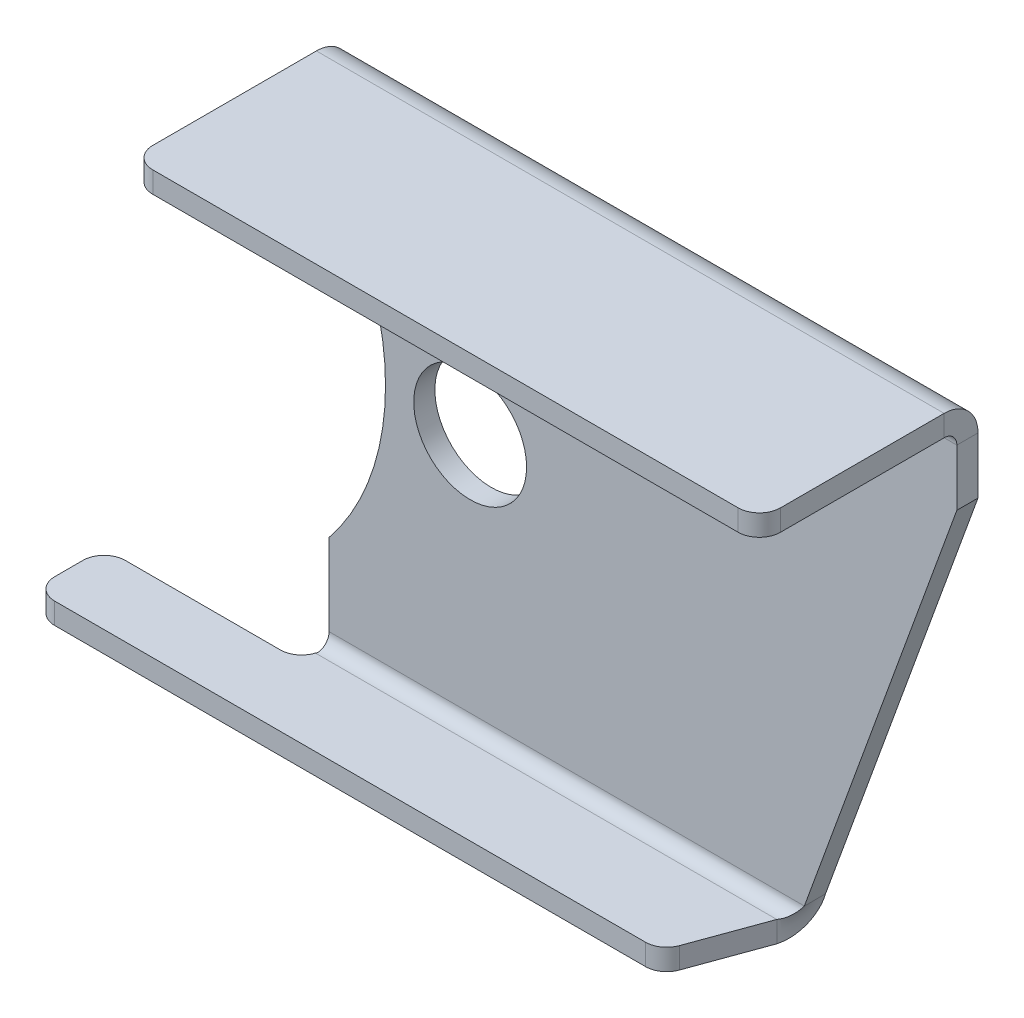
ISO-10303-21;
HEADER;
FILE_DESCRIPTION(('STEP AP214'),'2;1');
FILE_NAME('part.step','',(''),(''),'','','');
FILE_SCHEMA(('AUTOMOTIVE_DESIGN { 1 0 10303 214 1 1 1 1 }'));
ENDSEC;
DATA;
#1=APPLICATION_CONTEXT('core data for automotive mechanical design processes');
#2=APPLICATION_PROTOCOL_DEFINITION('international standard','automotive_design',2000,#1);
#3=PRODUCT_CONTEXT('',#1,'mechanical');
#4=PRODUCT('Part','Part','',(#3));
#5=PRODUCT_RELATED_PRODUCT_CATEGORY('part','',(#4));
#6=PRODUCT_DEFINITION_FORMATION('','',#4);
#7=PRODUCT_DEFINITION_CONTEXT('part definition',#1,'design');
#8=PRODUCT_DEFINITION('design','',#6,#7);
#9=PRODUCT_DEFINITION_SHAPE('','',#8);
#10=(LENGTH_UNIT() NAMED_UNIT(*) SI_UNIT(.MILLI.,.METRE.));
#11=(NAMED_UNIT(*) PLANE_ANGLE_UNIT() SI_UNIT($,.RADIAN.));
#12=(NAMED_UNIT(*) SI_UNIT($,.STERADIAN.) SOLID_ANGLE_UNIT());
#13=UNCERTAINTY_MEASURE_WITH_UNIT(LENGTH_MEASURE(1.E-05),#10,'distance_accuracy_value','');
#14=(GEOMETRIC_REPRESENTATION_CONTEXT(3) GLOBAL_UNCERTAINTY_ASSIGNED_CONTEXT((#13)) GLOBAL_UNIT_ASSIGNED_CONTEXT((#10,
#11,#12)) REPRESENTATION_CONTEXT('',''));
#15=CARTESIAN_POINT('',(0.,0.,0.));
#16=DIRECTION('',(0.,0.,1.));
#17=DIRECTION('',(1.,0.,0.));
#18=AXIS2_PLACEMENT_3D('',#15,#16,#17);
#19=CARTESIAN_POINT('',(86.7644782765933,-35.9999999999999,12.3999999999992));
#20=DIRECTION('',(0.,1.,0.));
#21=DIRECTION('',(1.,0.,0.));
#22=AXIS2_PLACEMENT_3D('',#19,#20,#21);
#23=PLANE('',#22);
#24=DIRECTION('',(0.342020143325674,0.,-0.93969262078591));
#25=VECTOR('',#24,1.);
#26=CARTESIAN_POINT('',(117.,-36.0000000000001,-61.9000000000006));
#27=LINE('',#26,#25);
#28=CARTESIAN_POINT('',(89.583556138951,-35.9999999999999,13.4260604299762));
#29=VERTEX_POINT('',#28);
#30=CARTESIAN_POINT('',(93.2691407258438,-35.9999999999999,3.29999999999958));
#31=VERTEX_POINT('',#30);
#32=EDGE_CURVE('E263',#29,#31,#27,.T.);
#33=ORIENTED_EDGE('',*,*,#32,.T.);
#34=DIRECTION('',(-1.,0.,0.));
#35=VECTOR('',#34,1.);
#36=CARTESIAN_POINT('',(86.7644782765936,-35.9999999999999,3.29999999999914));
#37=LINE('',#36,#35);
#38=CARTESIAN_POINT('',(27.8618176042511,-35.9999999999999,3.30000000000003));
#39=VERTEX_POINT('',#38);
#40=EDGE_CURVE('E218',#31,#39,#37,.T.);
#41=ORIENTED_EDGE('',*,*,#40,.T.);
#42=CARTESIAN_POINT('',(25.,-35.9999999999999,2.39999999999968));
#43=DIRECTION('',(0.,-1.,0.));
#44=DIRECTION('',(1.,0.,0.));
#45=AXIS2_PLACEMENT_3D('',#42,#43,#44);
#46=CIRCLE('',#45,3.);
#47=CARTESIAN_POINT('',(25.,-35.9999999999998,5.39999999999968));
#48=VERTEX_POINT('',#47);
#49=EDGE_CURVE('E267',#39,#48,#46,.T.);
#50=ORIENTED_EDGE('',*,*,#49,.T.);
#51=DIRECTION('',(-1.,0.,0.));
#52=VECTOR('',#51,1.);
#53=CARTESIAN_POINT('',(3.,-35.9999999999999,5.40000000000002));
#54=LINE('',#53,#52);
#55=CARTESIAN_POINT('',(3.,-35.9999999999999,5.40000000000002));
#56=VERTEX_POINT('',#55);
#57=EDGE_CURVE('E264',#48,#56,#54,.T.);
#58=ORIENTED_EDGE('',*,*,#57,.T.);
#59=CARTESIAN_POINT('',(3.00000000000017,-35.9999999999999,8.39999999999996));
#60=DIRECTION('',(0.,1.,0.));
#61=DIRECTION('',(-1.,0.,0.));
#62=AXIS2_PLACEMENT_3D('',#59,#60,#61);
#63=CIRCLE('',#62,3.);
#64=CARTESIAN_POINT('',(1.80411241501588E-13,-35.9999999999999,8.40000000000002));
#65=VERTEX_POINT('',#64);
#66=EDGE_CURVE('E266',#56,#65,#63,.T.);
#67=ORIENTED_EDGE('',*,*,#66,.T.);
#68=DIRECTION('',(0.,0.,1.));
#69=VECTOR('',#68,1.);
#70=CARTESIAN_POINT('',(1.80411241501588E-13,-35.9999999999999,8.40000000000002));
#71=LINE('',#70,#69);
#72=CARTESIAN_POINT('',(0.,-36.,12.4));
#73=VERTEX_POINT('',#72);
#74=EDGE_CURVE('E269',#65,#73,#71,.T.);
#75=ORIENTED_EDGE('',*,*,#74,.T.);
#76=CARTESIAN_POINT('',(2.99999999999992,-36.,12.4));
#77=DIRECTION('',(0.,1.,0.));
#78=DIRECTION('',(-1.,0.,0.));
#79=AXIS2_PLACEMENT_3D('',#76,#77,#78);
#80=CIRCLE('',#79,3.);
#81=CARTESIAN_POINT('',(3.,-36.,15.4));
#82=VERTEX_POINT('',#81);
#83=EDGE_CURVE('E271',#73,#82,#80,.T.);
#84=ORIENTED_EDGE('',*,*,#83,.T.);
#85=DIRECTION('',(1.,0.,0.));
#86=VECTOR('',#85,1.);
#87=CARTESIAN_POINT('',(3.,-36.,15.4));
#88=LINE('',#87,#86);
#89=CARTESIAN_POINT('',(86.7644782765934,-35.9999999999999,15.3999999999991));
#90=VERTEX_POINT('',#89);
#91=EDGE_CURVE('E273',#82,#90,#88,.T.);
#92=ORIENTED_EDGE('',*,*,#91,.T.);
#93=CARTESIAN_POINT('',(86.7644782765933,-35.9999999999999,12.3999999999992));
#94=DIRECTION('',(0.,1.,0.));
#95=DIRECTION('',(1.,0.,0.));
#96=AXIS2_PLACEMENT_3D('',#93,#94,#95);
#97=CIRCLE('',#96,3.);
#98=EDGE_CURVE('E275',#90,#29,#97,.T.);
#99=ORIENTED_EDGE('',*,*,#98,.T.);
#100=EDGE_LOOP('',(#33,#41,#50,#58,#67,#75,#84,#92,#99));
#101=FACE_BOUND('',#100,.T.);
#102=ADVANCED_FACE('F32',(#101),#23,.T.);
#103=CARTESIAN_POINT('',(86.7644782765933,-38.9999999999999,12.3999999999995));
#104=DIRECTION('',(0.,1.,0.));
#105=DIRECTION('',(1.,0.,0.));
#106=AXIS2_PLACEMENT_3D('',#103,#104,#105);
#107=PLANE('',#106);
#108=DIRECTION('',(-1.,0.,0.));
#109=VECTOR('',#108,1.);
#110=CARTESIAN_POINT('',(86.7644782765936,-38.9999999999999,3.29999999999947));
#111=LINE('',#110,#109);
#112=CARTESIAN_POINT('',(93.2691407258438,-38.9999999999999,3.29999999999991));
#113=VERTEX_POINT('',#112);
#114=CARTESIAN_POINT('',(27.861817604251,-38.9999999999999,3.30000000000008));
#115=VERTEX_POINT('',#114);
#116=EDGE_CURVE('E298',#113,#115,#111,.T.);
#117=ORIENTED_EDGE('',*,*,#116,.F.);
#118=DIRECTION('',(0.342020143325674,0.,-0.93969262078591));
#119=VECTOR('',#118,1.);
#120=CARTESIAN_POINT('',(117.,-39.0000000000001,-61.9));
#121=LINE('',#120,#119);
#122=CARTESIAN_POINT('',(89.583556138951,-38.9999999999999,13.4260604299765));
#123=VERTEX_POINT('',#122);
#124=EDGE_CURVE('E406',#123,#113,#121,.T.);
#125=ORIENTED_EDGE('',*,*,#124,.F.);
#126=CARTESIAN_POINT('',(86.7644782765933,-38.9999999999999,12.3999999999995));
#127=DIRECTION('',(0.,1.,0.));
#128=DIRECTION('',(1.,0.,0.));
#129=AXIS2_PLACEMENT_3D('',#126,#127,#128);
#130=CIRCLE('',#129,3.);
#131=CARTESIAN_POINT('',(86.7644782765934,-38.9999999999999,15.3999999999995));
#132=VERTEX_POINT('',#131);
#133=EDGE_CURVE('E261',#132,#123,#130,.T.);
#134=ORIENTED_EDGE('',*,*,#133,.F.);
#135=DIRECTION('',(1.,0.,0.));
#136=VECTOR('',#135,1.);
#137=CARTESIAN_POINT('',(2.99999999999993,-39.,15.4000000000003));
#138=LINE('',#137,#136);
#139=CARTESIAN_POINT('',(2.99999999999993,-39.,15.4000000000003));
#140=VERTEX_POINT('',#139);
#141=EDGE_CURVE('E259',#140,#132,#138,.T.);
#142=ORIENTED_EDGE('',*,*,#141,.F.);
#143=CARTESIAN_POINT('',(2.99999999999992,-39.,12.4000000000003));
#144=DIRECTION('',(0.,1.,0.));
#145=DIRECTION('',(-1.,0.,0.));
#146=AXIS2_PLACEMENT_3D('',#143,#144,#145);
#147=CIRCLE('',#146,3.);
#148=CARTESIAN_POINT('',(0.,-39.,12.4000000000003));
#149=VERTEX_POINT('',#148);
#150=EDGE_CURVE('E257',#149,#140,#147,.T.);
#151=ORIENTED_EDGE('',*,*,#150,.F.);
#152=DIRECTION('',(0.,0.,1.));
#153=VECTOR('',#152,1.);
#154=CARTESIAN_POINT('',(1.80411241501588E-13,-38.9999999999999,8.40000000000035));
#155=LINE('',#154,#153);
#156=CARTESIAN_POINT('',(1.80411241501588E-13,-38.9999999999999,8.40000000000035));
#157=VERTEX_POINT('',#156);
#158=EDGE_CURVE('E255',#157,#149,#155,.T.);
#159=ORIENTED_EDGE('',*,*,#158,.F.);
#160=CARTESIAN_POINT('',(3.00000000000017,-38.9999999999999,8.40000000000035));
#161=DIRECTION('',(0.,1.,0.));
#162=DIRECTION('',(-1.,0.,0.));
#163=AXIS2_PLACEMENT_3D('',#160,#161,#162);
#164=CIRCLE('',#163,3.);
#165=CARTESIAN_POINT('',(3.,-38.9999999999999,5.40000000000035));
#166=VERTEX_POINT('',#165);
#167=EDGE_CURVE('E252',#166,#157,#164,.T.);
#168=ORIENTED_EDGE('',*,*,#167,.F.);
#169=DIRECTION('',(-1.,0.,0.));
#170=VECTOR('',#169,1.);
#171=CARTESIAN_POINT('',(3.,-38.9999999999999,5.40000000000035));
#172=LINE('',#171,#170);
#173=CARTESIAN_POINT('',(25.,-38.9999999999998,5.39999999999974));
#174=VERTEX_POINT('',#173);
#175=EDGE_CURVE('E250',#174,#166,#172,.T.);
#176=ORIENTED_EDGE('',*,*,#175,.F.);
#177=CARTESIAN_POINT('',(25.,-38.9999999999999,2.39999999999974));
#178=DIRECTION('',(0.,-1.,0.));
#179=DIRECTION('',(1.,0.,0.));
#180=AXIS2_PLACEMENT_3D('',#177,#178,#179);
#181=CIRCLE('',#180,3.);
#182=EDGE_CURVE('E253',#115,#174,#181,.T.);
#183=ORIENTED_EDGE('',*,*,#182,.F.);
#184=EDGE_LOOP('',(#117,#125,#134,#142,#151,#159,#168,#176,#183));
#185=FACE_BOUND('',#184,.T.);
#186=ADVANCED_FACE('F345',(#185),#107,.F.);
#187=CARTESIAN_POINT('',(117.,-36.0000000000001,-61.9000000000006));
#188=DIRECTION('',(-0.939692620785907,0.,-0.342020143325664));
#189=DIRECTION('',(-0.342020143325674,0.,0.93969262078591));
#190=AXIS2_PLACEMENT_3D('',#187,#188,#189);
#191=PLANE('',#190);
#192=CARTESIAN_POINT('',(93.2691407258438,-35.9999999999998,3.29999999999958));
#193=CARTESIAN_POINT('',(93.2691407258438,-38.9999999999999,3.29999999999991));
#194=B_SPLINE_CURVE_WITH_KNOTS('',1,(#192,#193),.UNSPECIFIED.,.F.,.F.,(2,2),(0.,1.),.UNSPECIFIED.);
#195=EDGE_CURVE('E42',#31,#113,#194,.T.);
#196=ORIENTED_EDGE('',*,*,#195,.F.);
#197=ORIENTED_EDGE('',*,*,#32,.F.);
#198=DIRECTION('',(0.,-1.,0.));
#199=VECTOR('',#198,1.);
#200=CARTESIAN_POINT('',(89.583556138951,-35.9999999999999,13.4260604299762));
#201=LINE('',#200,#199);
#202=EDGE_CURVE('E277',#29,#123,#201,.T.);
#203=ORIENTED_EDGE('',*,*,#202,.T.);
#204=ORIENTED_EDGE('',*,*,#124,.T.);
#205=EDGE_LOOP('',(#196,#197,#203,#204));
#206=FACE_BOUND('',#205,.T.);
#207=ADVANCED_FACE('F34',(#206),#191,.F.);
#208=CARTESIAN_POINT('',(25.,-35.9999999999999,2.39999999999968));
#209=DIRECTION('',(0.,-1.,0.));
#210=DIRECTION('',(-1.,0.,0.));
#211=AXIS2_PLACEMENT_3D('',#208,#209,#210);
#212=CYLINDRICAL_SURFACE('',#211,3.);
#213=CARTESIAN_POINT('',(27.8618176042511,-38.9999999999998,3.30000000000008));
#214=CARTESIAN_POINT('',(27.8618176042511,-35.9999999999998,3.30000000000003));
#215=B_SPLINE_CURVE_WITH_KNOTS('',1,(#213,#214),.UNSPECIFIED.,.F.,.F.,(2,2),(0.,1.),.UNSPECIFIED.);
#216=EDGE_CURVE('E11',#115,#39,#215,.T.);
#217=ORIENTED_EDGE('',*,*,#216,.F.);
#218=ORIENTED_EDGE('',*,*,#182,.T.);
#219=DIRECTION('',(0.,-1.,0.));
#220=VECTOR('',#219,1.);
#221=CARTESIAN_POINT('',(25.,-35.9999999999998,5.39999999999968));
#222=LINE('',#221,#220);
#223=EDGE_CURVE('E295',#48,#174,#222,.T.);
#224=ORIENTED_EDGE('',*,*,#223,.F.);
#225=ORIENTED_EDGE('',*,*,#49,.F.);
#226=EDGE_LOOP('',(#217,#218,#224,#225));
#227=FACE_BOUND('',#226,.T.);
#228=ADVANCED_FACE('F309',(#227),#212,.F.);
#229=CARTESIAN_POINT('',(3.,-35.9999999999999,5.40000000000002));
#230=DIRECTION('',(0.,0.,1.));
#231=DIRECTION('',(1.,0.,0.));
#232=AXIS2_PLACEMENT_3D('',#229,#230,#231);
#233=PLANE('',#232);
#234=ORIENTED_EDGE('',*,*,#175,.T.);
#235=DIRECTION('',(0.,-1.,0.));
#236=VECTOR('',#235,1.);
#237=CARTESIAN_POINT('',(3.,-35.9999999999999,5.40000000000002));
#238=LINE('',#237,#236);
#239=EDGE_CURVE('E292',#56,#166,#238,.T.);
#240=ORIENTED_EDGE('',*,*,#239,.F.);
#241=ORIENTED_EDGE('',*,*,#57,.F.);
#242=ORIENTED_EDGE('',*,*,#223,.T.);
#243=EDGE_LOOP('',(#234,#240,#241,#242));
#244=FACE_BOUND('',#243,.T.);
#245=ADVANCED_FACE('F318',(#244),#233,.F.);
#246=CARTESIAN_POINT('',(3.00000000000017,-35.9999999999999,8.39999999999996));
#247=DIRECTION('',(0.,-1.,0.));
#248=DIRECTION('',(-1.,0.,0.));
#249=AXIS2_PLACEMENT_3D('',#246,#247,#248);
#250=CYLINDRICAL_SURFACE('',#249,3.);
#251=ORIENTED_EDGE('',*,*,#167,.T.);
#252=DIRECTION('',(0.,-1.,0.));
#253=VECTOR('',#252,1.);
#254=CARTESIAN_POINT('',(1.80411241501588E-13,-35.9999999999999,8.40000000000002));
#255=LINE('',#254,#253);
#256=EDGE_CURVE('E289',#65,#157,#255,.T.);
#257=ORIENTED_EDGE('',*,*,#256,.F.);
#258=ORIENTED_EDGE('',*,*,#66,.F.);
#259=ORIENTED_EDGE('',*,*,#239,.T.);
#260=EDGE_LOOP('',(#251,#257,#258,#259));
#261=FACE_BOUND('',#260,.T.);
#262=ADVANCED_FACE('F321',(#261),#250,.T.);
#263=CARTESIAN_POINT('',(1.80411241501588E-13,-35.9999999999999,8.40000000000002));
#264=DIRECTION('',(1.,0.,0.));
#265=DIRECTION('',(0.,0.,-1.));
#266=AXIS2_PLACEMENT_3D('',#263,#264,#265);
#267=PLANE('',#266);
#268=ORIENTED_EDGE('',*,*,#158,.T.);
#269=DIRECTION('',(0.,-1.,0.));
#270=VECTOR('',#269,1.);
#271=CARTESIAN_POINT('',(0.,-36.,12.4));
#272=LINE('',#271,#270);
#273=EDGE_CURVE('E286',#73,#149,#272,.T.);
#274=ORIENTED_EDGE('',*,*,#273,.F.);
#275=ORIENTED_EDGE('',*,*,#74,.F.);
#276=ORIENTED_EDGE('',*,*,#256,.T.);
#277=EDGE_LOOP('',(#268,#274,#275,#276));
#278=FACE_BOUND('',#277,.T.);
#279=ADVANCED_FACE('F325',(#278),#267,.F.);
#280=CARTESIAN_POINT('',(2.99999999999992,-36.,12.4));
#281=DIRECTION('',(0.,-1.,0.));
#282=DIRECTION('',(-1.,0.,0.));
#283=AXIS2_PLACEMENT_3D('',#280,#281,#282);
#284=CYLINDRICAL_SURFACE('',#283,3.);
#285=ORIENTED_EDGE('',*,*,#150,.T.);
#286=DIRECTION('',(0.,-1.,0.));
#287=VECTOR('',#286,1.);
#288=CARTESIAN_POINT('',(3.,-36.,15.4));
#289=LINE('',#288,#287);
#290=EDGE_CURVE('E283',#82,#140,#289,.T.);
#291=ORIENTED_EDGE('',*,*,#290,.F.);
#292=ORIENTED_EDGE('',*,*,#83,.F.);
#293=ORIENTED_EDGE('',*,*,#273,.T.);
#294=EDGE_LOOP('',(#285,#291,#292,#293));
#295=FACE_BOUND('',#294,.T.);
#296=ADVANCED_FACE('F329',(#295),#284,.T.);
#297=CARTESIAN_POINT('',(3.,-36.,15.4));
#298=DIRECTION('',(0.,0.,-1.));
#299=DIRECTION('',(-1.,0.,0.));
#300=AXIS2_PLACEMENT_3D('',#297,#298,#299);
#301=PLANE('',#300);
#302=ORIENTED_EDGE('',*,*,#141,.T.);
#303=DIRECTION('',(0.,-1.,0.));
#304=VECTOR('',#303,1.);
#305=CARTESIAN_POINT('',(86.7644782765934,-35.9999999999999,15.3999999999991));
#306=LINE('',#305,#304);
#307=EDGE_CURVE('E280',#90,#132,#306,.T.);
#308=ORIENTED_EDGE('',*,*,#307,.F.);
#309=ORIENTED_EDGE('',*,*,#91,.F.);
#310=ORIENTED_EDGE('',*,*,#290,.T.);
#311=EDGE_LOOP('',(#302,#308,#309,#310));
#312=FACE_BOUND('',#311,.T.);
#313=ADVANCED_FACE('F333',(#312),#301,.F.);
#314=CARTESIAN_POINT('',(86.7644782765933,-35.9999999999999,12.3999999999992));
#315=DIRECTION('',(0.,-1.,0.));
#316=DIRECTION('',(-1.,0.,0.));
#317=AXIS2_PLACEMENT_3D('',#314,#315,#316);
#318=CYLINDRICAL_SURFACE('',#317,3.);
#319=ORIENTED_EDGE('',*,*,#133,.T.);
#320=ORIENTED_EDGE('',*,*,#202,.F.);
#321=ORIENTED_EDGE('',*,*,#98,.F.);
#322=ORIENTED_EDGE('',*,*,#307,.T.);
#323=EDGE_LOOP('',(#319,#320,#321,#322));
#324=FACE_BOUND('',#323,.T.);
#325=ADVANCED_FACE('F337',(#324),#318,.T.);
#326=CARTESIAN_POINT('',(86.7644782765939,35.0000000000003,-84.8000000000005));
#327=DIRECTION('',(0.,-1.,0.));
#328=DIRECTION('',(1.,0.,0.));
#329=AXIS2_PLACEMENT_3D('',#326,#327,#328);
#330=PLANE('',#329);
#331=DIRECTION('',(0.,0.,-1.));
#332=VECTOR('',#331,1.);
#333=CARTESIAN_POINT('',(28.,34.9999999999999,26.4999999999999));
#334=LINE('',#333,#332);
#335=CARTESIAN_POINT('',(28.,34.9999999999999,26.4999999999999));
#336=VERTEX_POINT('',#335);
#337=CARTESIAN_POINT('',(28.0000000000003,35.0000000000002,3.30000000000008));
#338=VERTEX_POINT('',#337);
#339=EDGE_CURVE('E428',#336,#338,#334,.T.);
#340=ORIENTED_EDGE('',*,*,#339,.T.);
#341=DIRECTION('',(1.,0.,0.));
#342=VECTOR('',#341,1.);
#343=CARTESIAN_POINT('',(86.7644782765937,35.0000000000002,3.29999999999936));
#344=LINE('',#343,#342);
#345=CARTESIAN_POINT('',(117.,35.0000000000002,3.29999999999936));
#346=VERTEX_POINT('',#345);
#347=EDGE_CURVE('E413',#338,#346,#344,.T.);
#348=ORIENTED_EDGE('',*,*,#347,.T.);
#349=DIRECTION('',(0.,0.,1.));
#350=VECTOR('',#349,1.);
#351=CARTESIAN_POINT('',(117.,35.,26.4999999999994));
#352=LINE('',#351,#350);
#353=CARTESIAN_POINT('',(117.,35.,26.4999999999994));
#354=VERTEX_POINT('',#353);
#355=EDGE_CURVE('E437',#346,#354,#352,.T.);
#356=ORIENTED_EDGE('',*,*,#355,.T.);
#357=CARTESIAN_POINT('',(114.,35.,26.4999999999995));
#358=DIRECTION('',(0.,-1.,0.));
#359=DIRECTION('',(-1.,0.,0.));
#360=AXIS2_PLACEMENT_3D('',#357,#358,#359);
#361=CIRCLE('',#360,3.);
#362=CARTESIAN_POINT('',(114.,35.,29.4999999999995));
#363=VERTEX_POINT('',#362);
#364=EDGE_CURVE('E435',#354,#363,#361,.T.);
#365=ORIENTED_EDGE('',*,*,#364,.T.);
#366=DIRECTION('',(-1.,0.,0.));
#367=VECTOR('',#366,1.);
#368=CARTESIAN_POINT('',(31.,35.,29.4999999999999));
#369=LINE('',#368,#367);
#370=CARTESIAN_POINT('',(31.,35.,29.4999999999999));
#371=VERTEX_POINT('',#370);
#372=EDGE_CURVE('E433',#363,#371,#369,.T.);
#373=ORIENTED_EDGE('',*,*,#372,.T.);
#374=CARTESIAN_POINT('',(31.,34.9999999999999,26.4999999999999));
#375=DIRECTION('',(0.,-1.,0.));
#376=DIRECTION('',(-1.,0.,0.));
#377=AXIS2_PLACEMENT_3D('',#374,#375,#376);
#378=CIRCLE('',#377,3.);
#379=EDGE_CURVE('E431',#371,#336,#378,.T.);
#380=ORIENTED_EDGE('',*,*,#379,.T.);
#381=EDGE_LOOP('',(#340,#348,#356,#365,#373,#380));
#382=FACE_BOUND('',#381,.T.);
#383=ADVANCED_FACE('F341',(#382),#330,.T.);
#384=CARTESIAN_POINT('',(86.7644782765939,38.0000000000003,-84.8000000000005));
#385=DIRECTION('',(0.,-1.,0.));
#386=DIRECTION('',(1.,0.,0.));
#387=AXIS2_PLACEMENT_3D('',#384,#385,#386);
#388=PLANE('',#387);
#389=DIRECTION('',(1.,0.,0.));
#390=VECTOR('',#389,1.);
#391=CARTESIAN_POINT('',(86.7644782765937,38.0000000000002,3.29999999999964));
#392=LINE('',#391,#390);
#393=CARTESIAN_POINT('',(28.0000000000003,38.0000000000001,3.30000000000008));
#394=VERTEX_POINT('',#393);
#395=CARTESIAN_POINT('',(117.,38.0000000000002,3.29999999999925));
#396=VERTEX_POINT('',#395);
#397=EDGE_CURVE('E410',#394,#396,#392,.T.);
#398=ORIENTED_EDGE('',*,*,#397,.F.);
#399=DIRECTION('',(0.,0.,-1.));
#400=VECTOR('',#399,1.);
#401=CARTESIAN_POINT('',(28.,37.9999999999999,26.5));
#402=LINE('',#401,#400);
#403=CARTESIAN_POINT('',(28.,37.9999999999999,26.5));
#404=VERTEX_POINT('',#403);
#405=EDGE_CURVE('E439',#404,#394,#402,.T.);
#406=ORIENTED_EDGE('',*,*,#405,.F.);
#407=CARTESIAN_POINT('',(31.,37.9999999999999,26.4999999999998));
#408=DIRECTION('',(0.,-1.,0.));
#409=DIRECTION('',(-1.,0.,0.));
#410=AXIS2_PLACEMENT_3D('',#407,#408,#409);
#411=CIRCLE('',#410,3.);
#412=CARTESIAN_POINT('',(31.,38.,29.4999999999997));
#413=VERTEX_POINT('',#412);
#414=EDGE_CURVE('E442',#413,#404,#411,.T.);
#415=ORIENTED_EDGE('',*,*,#414,.F.);
#416=DIRECTION('',(-1.,0.,0.));
#417=VECTOR('',#416,1.);
#418=CARTESIAN_POINT('',(31.,38.,29.4999999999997));
#419=LINE('',#418,#417);
#420=CARTESIAN_POINT('',(114.,38.,29.4999999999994));
#421=VERTEX_POINT('',#420);
#422=EDGE_CURVE('E444',#421,#413,#419,.T.);
#423=ORIENTED_EDGE('',*,*,#422,.F.);
#424=CARTESIAN_POINT('',(114.,38.,26.4999999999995));
#425=DIRECTION('',(0.,-1.,0.));
#426=DIRECTION('',(-1.,0.,0.));
#427=AXIS2_PLACEMENT_3D('',#424,#425,#426);
#428=CIRCLE('',#427,3.);
#429=CARTESIAN_POINT('',(117.,38.,26.4999999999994));
#430=VERTEX_POINT('',#429);
#431=EDGE_CURVE('E446',#430,#421,#428,.T.);
#432=ORIENTED_EDGE('',*,*,#431,.F.);
#433=DIRECTION('',(0.,0.,1.));
#434=VECTOR('',#433,1.);
#435=CARTESIAN_POINT('',(117.,38.,26.4999999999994));
#436=LINE('',#435,#434);
#437=EDGE_CURVE('E448',#396,#430,#436,.T.);
#438=ORIENTED_EDGE('',*,*,#437,.F.);
#439=EDGE_LOOP('',(#398,#406,#415,#423,#432,#438));
#440=FACE_BOUND('',#439,.T.);
#441=ADVANCED_FACE('F354',(#440),#388,.F.);
#442=CARTESIAN_POINT('',(117.,35.,26.4999999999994));
#443=DIRECTION('',(-1.,0.,0.));
#444=DIRECTION('',(0.,0.,-1.));
#445=AXIS2_PLACEMENT_3D('',#442,#443,#444);
#446=PLANE('',#445);
#447=DIRECTION('',(0.,-1.,0.));
#448=VECTOR('',#447,1.);
#449=CARTESIAN_POINT('',(117.,35.0000000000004,3.29999999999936));
#450=LINE('',#449,#448);
#451=EDGE_CURVE('E407',#396,#346,#450,.T.);
#452=ORIENTED_EDGE('',*,*,#451,.F.);
#453=ORIENTED_EDGE('',*,*,#437,.T.);
#454=DIRECTION('',(0.,1.,0.));
#455=VECTOR('',#454,1.);
#456=CARTESIAN_POINT('',(117.,35.,26.4999999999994));
#457=LINE('',#456,#455);
#458=EDGE_CURVE('E416',#354,#430,#457,.T.);
#459=ORIENTED_EDGE('',*,*,#458,.F.);
#460=ORIENTED_EDGE('',*,*,#355,.F.);
#461=EDGE_LOOP('',(#452,#453,#459,#460));
#462=FACE_BOUND('',#461,.T.);
#463=ADVANCED_FACE('F350',(#462),#446,.F.);
#464=CARTESIAN_POINT('',(114.,35.,26.4999999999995));
#465=DIRECTION('',(0.,1.,0.));
#466=DIRECTION('',(-1.,0.,0.));
#467=AXIS2_PLACEMENT_3D('',#464,#465,#466);
#468=CYLINDRICAL_SURFACE('',#467,3.);
#469=ORIENTED_EDGE('',*,*,#431,.T.);
#470=DIRECTION('',(0.,1.,0.));
#471=VECTOR('',#470,1.);
#472=CARTESIAN_POINT('',(114.,35.,29.4999999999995));
#473=LINE('',#472,#471);
#474=EDGE_CURVE('E419',#363,#421,#473,.T.);
#475=ORIENTED_EDGE('',*,*,#474,.F.);
#476=ORIENTED_EDGE('',*,*,#364,.F.);
#477=ORIENTED_EDGE('',*,*,#458,.T.);
#478=EDGE_LOOP('',(#469,#475,#476,#477));
#479=FACE_BOUND('',#478,.T.);
#480=ADVANCED_FACE('F353',(#479),#468,.T.);
#481=CARTESIAN_POINT('',(31.,35.,29.4999999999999));
#482=DIRECTION('',(0.,0.,-1.));
#483=DIRECTION('',(0.,1.,0.));
#484=AXIS2_PLACEMENT_3D('',#481,#482,#483);
#485=PLANE('',#484);
#486=ORIENTED_EDGE('',*,*,#422,.T.);
#487=DIRECTION('',(0.,1.,0.));
#488=VECTOR('',#487,1.);
#489=CARTESIAN_POINT('',(31.,35.,29.4999999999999));
#490=LINE('',#489,#488);
#491=EDGE_CURVE('E422',#371,#413,#490,.T.);
#492=ORIENTED_EDGE('',*,*,#491,.F.);
#493=ORIENTED_EDGE('',*,*,#372,.F.);
#494=ORIENTED_EDGE('',*,*,#474,.T.);
#495=EDGE_LOOP('',(#486,#492,#493,#494));
#496=FACE_BOUND('',#495,.T.);
#497=ADVANCED_FACE('F358',(#496),#485,.F.);
#498=CARTESIAN_POINT('',(31.,34.9999999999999,26.4999999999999));
#499=DIRECTION('',(0.,1.,0.));
#500=DIRECTION('',(-1.,0.,0.));
#501=AXIS2_PLACEMENT_3D('',#498,#499,#500);
#502=CYLINDRICAL_SURFACE('',#501,3.);
#503=ORIENTED_EDGE('',*,*,#414,.T.);
#504=DIRECTION('',(0.,1.,0.));
#505=VECTOR('',#504,1.);
#506=CARTESIAN_POINT('',(28.,34.9999999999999,26.4999999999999));
#507=LINE('',#506,#505);
#508=EDGE_CURVE('E425',#336,#404,#507,.T.);
#509=ORIENTED_EDGE('',*,*,#508,.F.);
#510=ORIENTED_EDGE('',*,*,#379,.F.);
#511=ORIENTED_EDGE('',*,*,#491,.T.);
#512=EDGE_LOOP('',(#503,#509,#510,#511));
#513=FACE_BOUND('',#512,.T.);
#514=ADVANCED_FACE('F362',(#513),#502,.T.);
#515=CARTESIAN_POINT('',(28.,34.9999999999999,26.4999999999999));
#516=DIRECTION('',(1.,0.,0.));
#517=DIRECTION('',(0.,0.,1.));
#518=AXIS2_PLACEMENT_3D('',#515,#516,#517);
#519=PLANE('',#518);
#520=DIRECTION('',(0.,1.,0.));
#521=VECTOR('',#520,1.);
#522=CARTESIAN_POINT('',(28.0000000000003,35.0000000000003,3.30000000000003));
#523=LINE('',#522,#521);
#524=EDGE_CURVE('E403',#338,#394,#523,.T.);
#525=ORIENTED_EDGE('',*,*,#524,.F.);
#526=ORIENTED_EDGE('',*,*,#339,.F.);
#527=ORIENTED_EDGE('',*,*,#508,.T.);
#528=ORIENTED_EDGE('',*,*,#405,.T.);
#529=EDGE_LOOP('',(#525,#526,#527,#528));
#530=FACE_BOUND('',#529,.T.);
#531=ADVANCED_FACE('F366',(#530),#519,.F.);
#532=CARTESIAN_POINT('',(28.,-22.6274169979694,1.49999999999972));
#533=DIRECTION('',(1.,0.,0.));
#534=DIRECTION('',(0.,1.,0.));
#535=AXIS2_PLACEMENT_3D('',#532,#533,#534);
#536=PLANE('',#535);
#537=DIRECTION('',(0.,-1.,0.));
#538=VECTOR('',#537,1.);
#539=CARTESIAN_POINT('',(28.0000000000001,-22.6274169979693,-1.50000000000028));
#540=LINE('',#539,#538);
#541=CARTESIAN_POINT('',(28.0000000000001,-22.6274169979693,-1.50000000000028));
#542=VERTEX_POINT('',#541);
#543=CARTESIAN_POINT('',(28.0000000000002,-34.1999999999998,-1.50000000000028));
#544=VERTEX_POINT('',#543);
#545=EDGE_CURVE('E238',#542,#544,#540,.T.);
#546=ORIENTED_EDGE('',*,*,#545,.T.);
#547=DIRECTION('',(0.,0.,1.));
#548=VECTOR('',#547,1.);
#549=CARTESIAN_POINT('',(28.0000000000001,-34.1999999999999,1.49999999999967));
#550=LINE('',#549,#548);
#551=CARTESIAN_POINT('',(28.,-34.1999999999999,1.49999999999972));
#552=VERTEX_POINT('',#551);
#553=EDGE_CURVE('E231',#544,#552,#550,.T.);
#554=ORIENTED_EDGE('',*,*,#553,.T.);
#555=DIRECTION('',(0.,-1.,0.));
#556=VECTOR('',#555,1.);
#557=CARTESIAN_POINT('',(28.,-22.6274169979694,1.49999999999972));
#558=LINE('',#557,#556);
#559=CARTESIAN_POINT('',(28.0000000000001,-22.6274169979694,1.49999999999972));
#560=VERTEX_POINT('',#559);
#561=EDGE_CURVE('E230',#560,#552,#558,.T.);
#562=ORIENTED_EDGE('',*,*,#561,.F.);
#563=DIRECTION('',(0.,0.,-1.));
#564=VECTOR('',#563,1.);
#565=CARTESIAN_POINT('',(28.0000000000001,-22.6274169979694,1.49999999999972));
#566=LINE('',#565,#564);
#567=EDGE_CURVE('E466',#560,#542,#566,.T.);
#568=ORIENTED_EDGE('',*,*,#567,.T.);
#569=EDGE_LOOP('',(#546,#554,#562,#568));
#570=FACE_BOUND('',#569,.T.);
#571=ADVANCED_FACE('F370',(#570),#536,.F.);
#572=CARTESIAN_POINT('',(86.7644782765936,-49.0999999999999,-1.50000000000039));
#573=DIRECTION('',(0.,0.,1.));
#574=DIRECTION('',(1.,0.,0.));
#575=AXIS2_PLACEMENT_3D('',#572,#573,#574);
#576=PLANE('',#575);
#577=CARTESIAN_POINT('',(48.0000000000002,0.,-1.50000000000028));
#578=DIRECTION('',(0.,0.,1.));
#579=DIRECTION('',(1.,0.,0.));
#580=AXIS2_PLACEMENT_3D('',#577,#578,#579);
#581=CIRCLE('',#580,8.);
#582=CARTESIAN_POINT('',(56.0000000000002,0.,-1.50000000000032));
#583=VERTEX_POINT('',#582);
#584=EDGE_CURVE('E480',#583,#583,#581,.T.);
#585=ORIENTED_EDGE('',*,*,#584,.T.);
#586=EDGE_LOOP('',(#585));
#587=FACE_BOUND('',#586,.T.);
#588=DIRECTION('',(0.34202014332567,0.939692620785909,0.));
#589=VECTOR('',#588,1.);
#590=CARTESIAN_POINT('',(117.,25.2000000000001,-1.50000000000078));
#591=LINE('',#590,#589);
#592=CARTESIAN_POINT('',(95.3801680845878,-34.1999999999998,-1.50000000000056));
#593=VERTEX_POINT('',#592);
#594=CARTESIAN_POINT('',(117.,25.2000000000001,-1.50000000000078));
#595=VERTEX_POINT('',#594);
#596=EDGE_CURVE('E395',#593,#595,#591,.T.);
#597=ORIENTED_EDGE('',*,*,#596,.F.);
#598=DIRECTION('',(-1.,0.,0.));
#599=VECTOR('',#598,1.);
#600=CARTESIAN_POINT('',(86.7644782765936,-34.1999999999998,-1.50000000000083));
#601=LINE('',#600,#599);
#602=EDGE_CURVE('E205',#593,#544,#601,.T.);
#603=ORIENTED_EDGE('',*,*,#602,.T.);
#604=ORIENTED_EDGE('',*,*,#545,.F.);
#605=CARTESIAN_POINT('',(2.91433543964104E-13,0.,-1.5));
#606=DIRECTION('',(0.,0.,-1.));
#607=DIRECTION('',(1.,0.,0.));
#608=AXIS2_PLACEMENT_3D('',#605,#606,#607);
#609=CIRCLE('',#608,36.);
#610=CARTESIAN_POINT('',(28.0000000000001,22.6274169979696,-1.50000000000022));
#611=VERTEX_POINT('',#610);
#612=EDGE_CURVE('E243',#611,#542,#609,.T.);
#613=ORIENTED_EDGE('',*,*,#612,.F.);
#614=DIRECTION('',(0.,-1.,0.));
#615=VECTOR('',#614,1.);
#616=CARTESIAN_POINT('',(28.0000000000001,62.2000000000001,-1.49999999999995));
#617=LINE('',#616,#615);
#618=CARTESIAN_POINT('',(28.0000000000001,33.2,-1.50000000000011));
#619=VERTEX_POINT('',#618);
#620=EDGE_CURVE('E474',#619,#611,#617,.T.);
#621=ORIENTED_EDGE('',*,*,#620,.F.);
#622=DIRECTION('',(1.,0.,0.));
#623=VECTOR('',#622,1.);
#624=CARTESIAN_POINT('',(86.7644782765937,33.2000000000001,-1.50000000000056));
#625=LINE('',#624,#623);
#626=CARTESIAN_POINT('',(117.,33.2000000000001,-1.50000000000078));
#627=VERTEX_POINT('',#626);
#628=EDGE_CURVE('E453',#619,#627,#625,.T.);
#629=ORIENTED_EDGE('',*,*,#628,.T.);
#630=DIRECTION('',(0.,1.,0.));
#631=VECTOR('',#630,1.);
#632=CARTESIAN_POINT('',(117.,62.2000000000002,-1.50000000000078));
#633=LINE('',#632,#631);
#634=EDGE_CURVE('E397',#595,#627,#633,.T.);
#635=ORIENTED_EDGE('',*,*,#634,.F.);
#636=EDGE_LOOP('',(#597,#603,#604,#613,#621,#629,#635));
#637=FACE_BOUND('',#636,.T.);
#638=ADVANCED_FACE('F382',(#587,#637),#576,.F.);
#639=CARTESIAN_POINT('',(117.,25.2000000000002,1.49999999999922));
#640=DIRECTION('',(-0.939692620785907,0.342020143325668,0.));
#641=DIRECTION('',(-0.34202014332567,-0.939692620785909,0.));
#642=AXIS2_PLACEMENT_3D('',#639,#640,#641);
#643=PLANE('',#642);
#644=DIRECTION('',(0.34202014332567,0.939692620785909,0.));
#645=VECTOR('',#644,1.);
#646=CARTESIAN_POINT('',(117.,25.2000000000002,1.49999999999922));
#647=LINE('',#646,#645);
#648=CARTESIAN_POINT('',(95.3801680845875,-34.1999999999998,1.49999999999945));
#649=VERTEX_POINT('',#648);
#650=CARTESIAN_POINT('',(117.,25.2000000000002,1.49999999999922));
#651=VERTEX_POINT('',#650);
#652=EDGE_CURVE('E227',#649,#651,#647,.T.);
#653=ORIENTED_EDGE('',*,*,#652,.F.);
#654=CARTESIAN_POINT('',(95.3801680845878,-34.1999999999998,-1.50000000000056));
#655=CARTESIAN_POINT('',(95.3801680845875,-34.1999999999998,1.49999999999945));
#656=B_SPLINE_CURVE_WITH_KNOTS('',1,(#654,#655),.UNSPECIFIED.,.F.,.F.,(2,2),(0.,1.),.UNSPECIFIED.);
#657=EDGE_CURVE('E190',#649,#593,#656,.F.);
#658=ORIENTED_EDGE('',*,*,#657,.T.);
#659=ORIENTED_EDGE('',*,*,#596,.T.);
#660=DIRECTION('',(0.,0.,-1.));
#661=VECTOR('',#660,1.);
#662=CARTESIAN_POINT('',(117.,25.2000000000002,1.49999999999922));
#663=LINE('',#662,#661);
#664=EDGE_CURVE('E236',#651,#595,#663,.T.);
#665=ORIENTED_EDGE('',*,*,#664,.F.);
#666=EDGE_LOOP('',(#653,#658,#659,#665));
#667=FACE_BOUND('',#666,.T.);
#668=ADVANCED_FACE('F234',(#667),#643,.F.);
#669=CARTESIAN_POINT('',(117.,62.2000000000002,1.49999999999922));
#670=DIRECTION('',(-1.,0.,0.));
#671=DIRECTION('',(0.,-1.,0.));
#672=AXIS2_PLACEMENT_3D('',#669,#670,#671);
#673=PLANE('',#672);
#674=ORIENTED_EDGE('',*,*,#634,.T.);
#675=DIRECTION('',(0.,0.,1.));
#676=VECTOR('',#675,1.);
#677=CARTESIAN_POINT('',(117.,33.2000000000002,1.499999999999));
#678=LINE('',#677,#676);
#679=CARTESIAN_POINT('',(117.,33.2000000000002,1.49999999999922));
#680=VERTEX_POINT('',#679);
#681=EDGE_CURVE('E456',#627,#680,#678,.T.);
#682=ORIENTED_EDGE('',*,*,#681,.T.);
#683=DIRECTION('',(0.,1.,0.));
#684=VECTOR('',#683,1.);
#685=CARTESIAN_POINT('',(117.,62.2000000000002,1.49999999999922));
#686=LINE('',#685,#684);
#687=EDGE_CURVE('E237',#651,#680,#686,.T.);
#688=ORIENTED_EDGE('',*,*,#687,.F.);
#689=ORIENTED_EDGE('',*,*,#664,.T.);
#690=EDGE_LOOP('',(#674,#682,#688,#689));
#691=FACE_BOUND('',#690,.T.);
#692=ADVANCED_FACE('F381',(#691),#673,.F.);
#693=CARTESIAN_POINT('',(28.0000000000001,62.2000000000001,1.50000000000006));
#694=DIRECTION('',(1.,0.,0.));
#695=DIRECTION('',(0.,1.,0.));
#696=AXIS2_PLACEMENT_3D('',#693,#694,#695);
#697=PLANE('',#696);
#698=DIRECTION('',(0.,-1.,0.));
#699=VECTOR('',#698,1.);
#700=CARTESIAN_POINT('',(28.0000000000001,62.2000000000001,1.50000000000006));
#701=LINE('',#700,#699);
#702=CARTESIAN_POINT('',(28.,33.2000000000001,1.49999999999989));
#703=VERTEX_POINT('',#702);
#704=CARTESIAN_POINT('',(28.,22.6274169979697,1.49999999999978));
#705=VERTEX_POINT('',#704);
#706=EDGE_CURVE('E240',#703,#705,#701,.T.);
#707=ORIENTED_EDGE('',*,*,#706,.F.);
#708=DIRECTION('',(0.,0.,-1.));
#709=VECTOR('',#708,1.);
#710=CARTESIAN_POINT('',(28.,33.2000000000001,1.49999999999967));
#711=LINE('',#710,#709);
#712=EDGE_CURVE('E459',#703,#619,#711,.T.);
#713=ORIENTED_EDGE('',*,*,#712,.T.);
#714=ORIENTED_EDGE('',*,*,#620,.T.);
#715=DIRECTION('',(0.,0.,-1.));
#716=VECTOR('',#715,1.);
#717=CARTESIAN_POINT('',(28.,22.6274169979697,1.49999999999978));
#718=LINE('',#717,#716);
#719=EDGE_CURVE('E463',#705,#611,#718,.T.);
#720=ORIENTED_EDGE('',*,*,#719,.F.);
#721=EDGE_LOOP('',(#707,#713,#714,#720));
#722=FACE_BOUND('',#721,.T.);
#723=ADVANCED_FACE('F634',(#722),#697,.F.);
#724=CARTESIAN_POINT('',(86.7644782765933,-49.0999999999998,1.49999999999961));
#725=DIRECTION('',(0.,0.,1.));
#726=DIRECTION('',(1.,0.,0.));
#727=AXIS2_PLACEMENT_3D('',#724,#725,#726);
#728=PLANE('',#727);
#729=DIRECTION('',(-1.,0.,0.));
#730=VECTOR('',#729,1.);
#731=CARTESIAN_POINT('',(86.7644782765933,-34.1999999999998,1.49999999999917));
#732=LINE('',#731,#730);
#733=EDGE_CURVE('E214',#649,#552,#732,.T.);
#734=ORIENTED_EDGE('',*,*,#733,.F.);
#735=ORIENTED_EDGE('',*,*,#652,.T.);
#736=ORIENTED_EDGE('',*,*,#687,.T.);
#737=DIRECTION('',(1.,0.,0.));
#738=VECTOR('',#737,1.);
#739=CARTESIAN_POINT('',(86.7644782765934,33.2000000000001,1.49999999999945));
#740=LINE('',#739,#738);
#741=EDGE_CURVE('E206',#703,#680,#740,.T.);
#742=ORIENTED_EDGE('',*,*,#741,.F.);
#743=ORIENTED_EDGE('',*,*,#706,.T.);
#744=CARTESIAN_POINT('',(0.,1.45716771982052E-13,1.5));
#745=DIRECTION('',(0.,0.,-1.));
#746=DIRECTION('',(1.,0.,0.));
#747=AXIS2_PLACEMENT_3D('',#744,#745,#746);
#748=CIRCLE('',#747,36.);
#749=EDGE_CURVE('E470',#705,#560,#748,.T.);
#750=ORIENTED_EDGE('',*,*,#749,.T.);
#751=ORIENTED_EDGE('',*,*,#561,.T.);
#752=EDGE_LOOP('',(#734,#735,#736,#742,#743,#750,#751));
#753=FACE_BOUND('',#752,.T.);
#754=CARTESIAN_POINT('',(48.0000000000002,2.28983498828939E-13,1.49999999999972));
#755=DIRECTION('',(0.,0.,1.));
#756=DIRECTION('',(1.,0.,0.));
#757=AXIS2_PLACEMENT_3D('',#754,#755,#756);
#758=CIRCLE('',#757,8.);
#759=CARTESIAN_POINT('',(56.0000000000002,2.36372119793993E-13,1.49999999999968));
#760=VERTEX_POINT('',#759);
#761=EDGE_CURVE('E398',#760,#760,#758,.T.);
#762=ORIENTED_EDGE('',*,*,#761,.F.);
#763=EDGE_LOOP('',(#762));
#764=FACE_BOUND('',#763,.T.);
#765=ADVANCED_FACE('F224',(#753,#764),#728,.T.);
#766=CARTESIAN_POINT('',(0.,1.45716771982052E-13,1.5));
#767=DIRECTION('',(0.,0.,-1.));
#768=DIRECTION('',(-1.,0.,0.));
#769=AXIS2_PLACEMENT_3D('',#766,#767,#768);
#770=CYLINDRICAL_SURFACE('',#769,36.);
#771=ORIENTED_EDGE('',*,*,#612,.T.);
#772=ORIENTED_EDGE('',*,*,#567,.F.);
#773=ORIENTED_EDGE('',*,*,#749,.F.);
#774=ORIENTED_EDGE('',*,*,#719,.T.);
#775=EDGE_LOOP('',(#771,#772,#773,#774));
#776=FACE_BOUND('',#775,.T.);
#777=ADVANCED_FACE('F628',(#776),#770,.F.);
#778=CARTESIAN_POINT('',(48.0000000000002,2.28983498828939E-13,1.49999999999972));
#779=DIRECTION('',(0.,0.,-1.));
#780=DIRECTION('',(-1.,0.,0.));
#781=AXIS2_PLACEMENT_3D('',#778,#779,#780);
#782=CYLINDRICAL_SURFACE('',#781,8.);
#783=ORIENTED_EDGE('',*,*,#761,.T.);
#784=EDGE_LOOP('',(#783));
#785=FACE_BOUND('',#784,.T.);
#786=ORIENTED_EDGE('',*,*,#584,.F.);
#787=EDGE_LOOP('',(#786));
#788=FACE_BOUND('',#787,.T.);
#789=ADVANCED_FACE('F671',(#785,#788),#782,.F.);
#790=CARTESIAN_POINT('',(117.,33.2000000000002,3.29999999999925));
#791=DIRECTION('',(-1.,0.,0.));
#792=DIRECTION('',(0.,-1.,0.));
#793=AXIS2_PLACEMENT_3D('',#790,#791,#792);
#794=PLANE('',#793);
#795=ORIENTED_EDGE('',*,*,#451,.T.);
#796=CARTESIAN_POINT('',(117.,33.2000000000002,3.29999999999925));
#797=DIRECTION('',(-1.,0.,0.));
#798=DIRECTION('',(0.,0.,1.));
#799=AXIS2_PLACEMENT_3D('',#796,#797,#798);
#800=CIRCLE('',#799,1.8);
#801=EDGE_CURVE('E488',#680,#346,#800,.F.);
#802=ORIENTED_EDGE('',*,*,#801,.F.);
#803=ORIENTED_EDGE('',*,*,#681,.F.);
#804=CARTESIAN_POINT('',(117.,33.2000000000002,3.29999999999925));
#805=DIRECTION('',(-1.,0.,0.));
#806=DIRECTION('',(0.,0.,1.));
#807=AXIS2_PLACEMENT_3D('',#804,#805,#806);
#808=CIRCLE('',#807,4.8);
#809=EDGE_CURVE('E483',#627,#396,#808,.F.);
#810=ORIENTED_EDGE('',*,*,#809,.T.);
#811=EDGE_LOOP('',(#795,#802,#803,#810));
#812=FACE_BOUND('',#811,.T.);
#813=ADVANCED_FACE('F646',(#812),#794,.F.);
#814=CARTESIAN_POINT('',(28.0000000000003,33.2000000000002,3.2999999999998));
#815=DIRECTION('',(1.,0.,0.));
#816=DIRECTION('',(0.,0.,-1.));
#817=AXIS2_PLACEMENT_3D('',#814,#815,#816);
#818=PLANE('',#817);
#819=ORIENTED_EDGE('',*,*,#712,.F.);
#820=CARTESIAN_POINT('',(28.0000000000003,33.2000000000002,3.2999999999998));
#821=DIRECTION('',(-1.,0.,0.));
#822=DIRECTION('',(0.,0.,1.));
#823=AXIS2_PLACEMENT_3D('',#820,#821,#822);
#824=CIRCLE('',#823,1.8);
#825=EDGE_CURVE('E491',#338,#703,#824,.T.);
#826=ORIENTED_EDGE('',*,*,#825,.F.);
#827=ORIENTED_EDGE('',*,*,#524,.T.);
#828=CARTESIAN_POINT('',(28.0000000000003,33.2000000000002,3.2999999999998));
#829=DIRECTION('',(-1.,0.,0.));
#830=DIRECTION('',(0.,0.,1.));
#831=AXIS2_PLACEMENT_3D('',#828,#829,#830);
#832=CIRCLE('',#831,4.8);
#833=EDGE_CURVE('E486',#394,#619,#832,.T.);
#834=ORIENTED_EDGE('',*,*,#833,.T.);
#835=EDGE_LOOP('',(#819,#826,#827,#834));
#836=FACE_BOUND('',#835,.T.);
#837=ADVANCED_FACE('F637',(#836),#818,.F.);
#838=CARTESIAN_POINT('',(288.777799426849,33.2000000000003,3.29999999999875));
#839=DIRECTION('',(-1.,0.,0.));
#840=DIRECTION('',(0.,0.,1.));
#841=AXIS2_PLACEMENT_3D('',#838,#839,#840);
#842=CYLINDRICAL_SURFACE('',#841,4.8);
#843=ORIENTED_EDGE('',*,*,#833,.F.);
#844=ORIENTED_EDGE('',*,*,#397,.T.);
#845=ORIENTED_EDGE('',*,*,#809,.F.);
#846=ORIENTED_EDGE('',*,*,#628,.F.);
#847=EDGE_LOOP('',(#843,#844,#845,#846));
#848=FACE_BOUND('',#847,.T.);
#849=ADVANCED_FACE('F648',(#848),#842,.T.);
#850=CARTESIAN_POINT('',(288.777799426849,33.2000000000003,3.29999999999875));
#851=DIRECTION('',(-1.,0.,0.));
#852=DIRECTION('',(0.,0.,1.));
#853=AXIS2_PLACEMENT_3D('',#850,#851,#852);
#854=CYLINDRICAL_SURFACE('',#853,1.8);
#855=ORIENTED_EDGE('',*,*,#825,.T.);
#856=ORIENTED_EDGE('',*,*,#741,.T.);
#857=ORIENTED_EDGE('',*,*,#801,.T.);
#858=ORIENTED_EDGE('',*,*,#347,.F.);
#859=EDGE_LOOP('',(#855,#856,#857,#858));
#860=FACE_BOUND('',#859,.T.);
#861=ADVANCED_FACE('F560',(#860),#854,.F.);
#862=CARTESIAN_POINT('',(28.0000000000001,-38.8581175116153,2.14157812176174));
#863=CARTESIAN_POINT('',(27.9992824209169,-38.8732259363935,2.20233044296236));
#864=CARTESIAN_POINT('',(27.9982069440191,-38.8855718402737,2.25699324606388));
#865=CARTESIAN_POINT('',(27.996056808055,-38.9009457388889,2.32957699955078));
#866=CARTESIAN_POINT('',(27.9952506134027,-38.9055438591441,2.35220416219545));
#867=CARTESIAN_POINT('',(27.9939070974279,-38.9117550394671,2.38376889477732));
#868=CARTESIAN_POINT('',(27.9934368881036,-38.9137109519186,2.39389453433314));
#869=CARTESIAN_POINT('',(27.9924517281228,-38.9174093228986,2.41335050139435));
#870=CARTESIAN_POINT('',(27.9921264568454,-38.9185718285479,2.41952804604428));
#871=CARTESIAN_POINT('',(27.9855834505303,-38.9385773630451,2.52828360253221));
#872=CARTESIAN_POINT('',(27.9767435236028,-38.9535275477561,2.62660819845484));
#873=CARTESIAN_POINT('',(27.9595063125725,-38.9710760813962,2.77160318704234));
#874=CARTESIAN_POINT('',(27.9530361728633,-38.9761858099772,2.81998736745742));
#875=CARTESIAN_POINT('',(27.9422443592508,-38.9827421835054,2.8926083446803));
#876=CARTESIAN_POINT('',(27.9384659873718,-38.9847429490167,2.91682279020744));
#877=CARTESIAN_POINT('',(27.9325267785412,-38.9874673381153,2.9531513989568));
#878=CARTESIAN_POINT('',(27.9305017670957,-38.988329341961,2.96526209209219));
#879=CARTESIAN_POINT('',(27.9263611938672,-38.9899611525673,2.9894850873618));
#880=CARTESIAN_POINT('',(27.9237178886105,-38.9909077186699,3.0045557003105));
#881=CARTESIAN_POINT('',(27.9090200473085,-38.9958305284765,3.08694569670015));
#882=CARTESIAN_POINT('',(27.8889338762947,-38.9999999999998,3.18238037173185));
#883=CARTESIAN_POINT('',(27.8618176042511,-38.9999999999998,3.30000000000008));
#884=CARTESIAN_POINT('',(28.0000000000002,-35.9467940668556,2.86559179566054));
#885=CARTESIAN_POINT('',(27.9992824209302,-35.9524597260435,2.88837391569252));
#886=CARTESIAN_POINT('',(27.9982069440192,-35.9570894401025,2.90887246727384));
#887=CARTESIAN_POINT('',(27.9960568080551,-35.9628546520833,2.93609137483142));
#888=CARTESIAN_POINT('',(27.9952506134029,-35.964578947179,2.94457656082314));
#889=CARTESIAN_POINT('',(27.993907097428,-35.9669081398,2.95641333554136));
#890=CARTESIAN_POINT('',(27.9934368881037,-35.9676416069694,2.96021045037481));
#891=CARTESIAN_POINT('',(27.992451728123,-35.9690284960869,2.96750643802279));
#892=CARTESIAN_POINT('',(27.9921264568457,-35.9694644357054,2.9698230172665));
#893=CARTESIAN_POINT('',(27.9855834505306,-35.9769665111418,3.01060635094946));
#894=CARTESIAN_POINT('',(27.976743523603,-35.9825728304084,3.04747807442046));
#895=CARTESIAN_POINT('',(27.9595063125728,-35.9891535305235,3.10185119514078));
#896=CARTESIAN_POINT('',(27.9530361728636,-35.9910696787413,3.11999526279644));
#897=CARTESIAN_POINT('',(27.942244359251,-35.9935283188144,3.147228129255));
#898=CARTESIAN_POINT('',(27.938465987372,-35.9942786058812,3.15630854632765));
#899=CARTESIAN_POINT('',(27.9325267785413,-35.9953002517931,3.16993177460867));
#900=CARTESIAN_POINT('',(27.9305017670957,-35.9956235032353,3.17447328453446));
#901=CARTESIAN_POINT('',(27.9263611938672,-35.9962354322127,3.18355690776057));
#902=CARTESIAN_POINT('',(27.9237178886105,-35.9965903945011,3.18920838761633));
#903=CARTESIAN_POINT('',(27.9090200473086,-35.9984364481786,3.22010463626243));
#904=CARTESIAN_POINT('',(27.8889331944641,-35.9999999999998,3.25589374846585));
#905=CARTESIAN_POINT('',(27.8618176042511,-35.9999999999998,3.30000000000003));
#906=B_SPLINE_SURFACE_WITH_KNOTS('',1,3,((#862,#863,#864,#865,#866,#867,#868,#869,#870,#871,
#872,#873,#874,#875,#876,#877,#878,#879,#880,#881,#882,#883),(#884,#885,#886,#887,#888,#889,
#890,#891,#892,#893,#894,#895,#896,#897,#898,#899,#900,#901,#902,#903,#904,#905)),.UNSPECIFIED.,
.F.,.F.,.F.,(2,2),(4,2,2,2,2,2,2,2,2,2,4),(0.,1.),(0.,0.125,0.1875,0.21875,0.25,0.5,0.625,
0.6875,0.71875,0.75,1.),.UNSPECIFIED.);
#907=CARTESIAN_POINT('',(27.8618176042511,-35.9999999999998,3.30000000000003));
#908=CARTESIAN_POINT('',(27.8889331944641,-35.9999999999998,3.25589374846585));
#909=CARTESIAN_POINT('',(27.9090200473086,-35.9984364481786,3.22010463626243));
#910=CARTESIAN_POINT('',(27.9237178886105,-35.9965903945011,3.18920838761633));
#911=CARTESIAN_POINT('',(27.9263611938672,-35.9962354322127,3.18355690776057));
#912=CARTESIAN_POINT('',(27.9305017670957,-35.9956235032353,3.17447328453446));
#913=CARTESIAN_POINT('',(27.9325267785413,-35.9953002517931,3.16993177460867));
#914=CARTESIAN_POINT('',(27.938465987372,-35.9942786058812,3.15630854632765));
#915=CARTESIAN_POINT('',(27.942244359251,-35.9935283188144,3.147228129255));
#916=CARTESIAN_POINT('',(27.9530361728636,-35.9910696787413,3.11999526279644));
#917=CARTESIAN_POINT('',(27.9595063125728,-35.9891535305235,3.10185119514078));
#918=CARTESIAN_POINT('',(27.976743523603,-35.9825728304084,3.04747807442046));
#919=CARTESIAN_POINT('',(27.9855834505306,-35.9769665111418,3.01060635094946));
#920=CARTESIAN_POINT('',(27.9921264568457,-35.9694644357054,2.9698230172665));
#921=CARTESIAN_POINT('',(27.992451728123,-35.9690284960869,2.96750643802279));
#922=CARTESIAN_POINT('',(27.9934368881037,-35.9676416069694,2.96021045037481));
#923=CARTESIAN_POINT('',(27.993907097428,-35.9669081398,2.95641333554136));
#924=CARTESIAN_POINT('',(27.9952506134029,-35.964578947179,2.94457656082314));
#925=CARTESIAN_POINT('',(27.9960568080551,-35.9628546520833,2.93609137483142));
#926=CARTESIAN_POINT('',(27.9982069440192,-35.9570894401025,2.90887246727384));
#927=CARTESIAN_POINT('',(27.9992824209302,-35.9524597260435,2.88837391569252));
#928=CARTESIAN_POINT('',(28.0000000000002,-35.9467940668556,2.86559179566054));
#929=B_SPLINE_CURVE_WITH_KNOTS('',3,(#907,#908,#909,#910,#911,#912,#913,#914,#915,#916,#917,
#918,#919,#920,#921,#922,#923,#924,#925,#926,#927,#928),.UNSPECIFIED.,.F.,.F.,(4,2,2,2,2,2,2,2,
2,2,4),(0.,0.25,0.28125,0.3125,0.375,0.5,0.75,0.78125,0.8125,0.875,1.),.UNSPECIFIED.);
#930=CARTESIAN_POINT('',(28.0000000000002,-35.9467940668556,2.86559179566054));
#931=VERTEX_POINT('',#930);
#932=EDGE_CURVE('E582',#931,#39,#929,.F.);
#933=CARTESIAN_POINT('',(28.0000000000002,-35.9467940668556,2.86559179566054));
#934=CARTESIAN_POINT('',(28.0000000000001,-38.8581175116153,2.14157812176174));
#935=B_SPLINE_CURVE_WITH_KNOTS('',1,(#933,#934),.UNSPECIFIED.,.F.,.F.,(2,2),(0.,1.),.UNSPECIFIED.);
#936=CARTESIAN_POINT('',(28.0000000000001,-38.8581175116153,2.14157812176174));
#937=VERTEX_POINT('',#936);
#938=EDGE_CURVE('E494',#931,#937,#935,.T.);
#939=CARTESIAN_POINT('',(28.0000000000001,-38.8581175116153,2.14157812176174));
#940=CARTESIAN_POINT('',(27.9992824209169,-38.8732259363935,2.20233044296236));
#941=CARTESIAN_POINT('',(27.9982069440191,-38.8855718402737,2.25699324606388));
#942=CARTESIAN_POINT('',(27.996056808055,-38.9009457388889,2.32957699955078));
#943=CARTESIAN_POINT('',(27.9952506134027,-38.9055438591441,2.35220416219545));
#944=CARTESIAN_POINT('',(27.9939070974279,-38.9117550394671,2.38376889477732));
#945=CARTESIAN_POINT('',(27.9934368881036,-38.9137109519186,2.39389453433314));
#946=CARTESIAN_POINT('',(27.9924517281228,-38.9174093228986,2.41335050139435));
#947=CARTESIAN_POINT('',(27.9921264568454,-38.9185718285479,2.41952804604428));
#948=CARTESIAN_POINT('',(27.9855834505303,-38.9385773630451,2.52828360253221));
#949=CARTESIAN_POINT('',(27.9767435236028,-38.9535275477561,2.62660819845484));
#950=CARTESIAN_POINT('',(27.9595063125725,-38.9710760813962,2.77160318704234));
#951=CARTESIAN_POINT('',(27.9530361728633,-38.9761858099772,2.81998736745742));
#952=CARTESIAN_POINT('',(27.9422443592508,-38.9827421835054,2.8926083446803));
#953=CARTESIAN_POINT('',(27.9384659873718,-38.9847429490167,2.91682279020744));
#954=CARTESIAN_POINT('',(27.9325267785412,-38.9874673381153,2.9531513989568));
#955=CARTESIAN_POINT('',(27.9305017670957,-38.988329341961,2.96526209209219));
#956=CARTESIAN_POINT('',(27.9263611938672,-38.9899611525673,2.9894850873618));
#957=CARTESIAN_POINT('',(27.9237178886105,-38.9909077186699,3.0045557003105));
#958=CARTESIAN_POINT('',(27.9090200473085,-38.9958305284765,3.08694569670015));
#959=CARTESIAN_POINT('',(27.8889338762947,-38.9999999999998,3.18238037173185));
#960=CARTESIAN_POINT('',(27.8618176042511,-38.9999999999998,3.30000000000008));
#961=B_SPLINE_CURVE_WITH_KNOTS('',3,(#939,#940,#941,#942,#943,#944,#945,#946,#947,#948,#949,
#950,#951,#952,#953,#954,#955,#956,#957,#958,#959,#960),.UNSPECIFIED.,.F.,.F.,(4,2,2,2,2,2,2,2,
2,2,4),(0.,0.125,0.1875,0.21875,0.25,0.5,0.625,0.6875,0.71875,0.75,1.),.UNSPECIFIED.);
#962=EDGE_CURVE('E870',#937,#115,#961,.T.);
#963=ORIENTED_EDGE('',*,*,#216,.T.);
#964=ORIENTED_EDGE('',*,*,#932,.F.);
#965=ORIENTED_EDGE('',*,*,#938,.T.);
#966=ORIENTED_EDGE('',*,*,#962,.T.);
#967=EDGE_LOOP('',(#963,#964,#965,#966));
#968=FACE_BOUND('',#967,.T.);
#969=ADVANCED_FACE('F549',(#968),#906,.F.);
#970=CARTESIAN_POINT('',(28.0000000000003,-34.1999999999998,3.29999999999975));
#971=DIRECTION('',(1.,0.,0.));
#972=DIRECTION('',(0.,1.,0.));
#973=AXIS2_PLACEMENT_3D('',#970,#971,#972);
#974=PLANE('',#973);
#975=ORIENTED_EDGE('',*,*,#938,.F.);
#976=CARTESIAN_POINT('',(28.0000000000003,-34.1999999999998,3.29999999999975));
#977=DIRECTION('',(1.,0.,0.));
#978=DIRECTION('',(0.,0.,-1.));
#979=AXIS2_PLACEMENT_3D('',#976,#977,#978);
#980=CIRCLE('',#979,1.8);
#981=EDGE_CURVE('E219',#552,#931,#980,.F.);
#982=ORIENTED_EDGE('',*,*,#981,.F.);
#983=ORIENTED_EDGE('',*,*,#553,.F.);
#984=CARTESIAN_POINT('',(28.0000000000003,-34.1999999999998,3.29999999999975));
#985=DIRECTION('',(1.,0.,0.));
#986=DIRECTION('',(0.,0.,-1.));
#987=AXIS2_PLACEMENT_3D('',#984,#985,#986);
#988=CIRCLE('',#987,4.8);
#989=EDGE_CURVE('E585',#544,#937,#988,.F.);
#990=ORIENTED_EDGE('',*,*,#989,.T.);
#991=EDGE_LOOP('',(#975,#982,#983,#990));
#992=FACE_BOUND('',#991,.T.);
#993=ADVANCED_FACE('F512',(#992),#974,.F.);
#994=CARTESIAN_POINT('',(93.2691407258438,-38.9999999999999,3.29999999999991));
#995=CARTESIAN_POINT('',(93.4450890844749,-38.9999999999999,2.67157642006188));
#996=CARTESIAN_POINT('',(93.6209786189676,-38.8750688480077,2.04361015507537));
#997=CARTESIAN_POINT('',(93.9728165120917,-38.3941746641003,0.882628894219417));
#998=CARTESIAN_POINT('',(94.1487354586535,-38.0384008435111,0.350175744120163));
#999=CARTESIAN_POINT('',(94.5005733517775,-37.1498242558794,-0.538400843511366));
#1000=CARTESIAN_POINT('',(94.6764922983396,-36.6173711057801,-0.8941746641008));
#1001=CARTESIAN_POINT('',(95.0283301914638,-35.4563898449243,-1.37506884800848));
#1002=CARTESIAN_POINT('',(95.2042197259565,-34.828423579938,-1.50000000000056));
#1003=CARTESIAN_POINT('',(95.3801680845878,-34.1999999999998,-1.50000000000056));
#1004=CARTESIAN_POINT('',(93.2691407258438,-35.9999999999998,3.29999999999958));
#1005=CARTESIAN_POINT('',(93.445080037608,-35.9999999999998,3.06435327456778));
#1006=CARTESIAN_POINT('',(93.6209786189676,-35.9531508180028,2.8288538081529));
#1007=CARTESIAN_POINT('',(93.9728165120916,-35.7728154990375,2.39348583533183));
#1008=CARTESIAN_POINT('',(94.1487354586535,-35.6394003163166,2.1938159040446));
#1009=CARTESIAN_POINT('',(94.5005733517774,-35.3061840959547,1.86059968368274));
#1010=CARTESIAN_POINT('',(94.6764922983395,-35.1065141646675,1.72718450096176));
#1011=CARTESIAN_POINT('',(95.0283301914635,-34.6711461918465,1.54684918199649));
#1012=CARTESIAN_POINT('',(95.2042287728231,-34.4356467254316,1.49999999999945));
#1013=CARTESIAN_POINT('',(95.3801680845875,-34.1999999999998,1.49999999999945));
#1014=B_SPLINE_SURFACE_WITH_KNOTS('',1,3,((#994,#995,#996,#997,#998,#999,#1000,#1001,#1002,
#1003),(#1004,#1005,#1006,#1007,#1008,#1009,#1010,#1011,#1012,#1013)),.UNSPECIFIED.,.F.,.F.,.F.,
(2,2),(4,2,2,2,4),(0.,1.),(0.,0.25,0.5,0.75,1.),.UNSPECIFIED.);
#1015=CARTESIAN_POINT('',(95.3801680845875,-34.1999999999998,1.49999999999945));
#1016=CARTESIAN_POINT('',(95.2042287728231,-34.4356467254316,1.49999999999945));
#1017=CARTESIAN_POINT('',(95.0283301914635,-34.6711461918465,1.54684918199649));
#1018=CARTESIAN_POINT('',(94.6764922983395,-35.1065141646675,1.72718450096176));
#1019=CARTESIAN_POINT('',(94.5005733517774,-35.3061840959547,1.86059968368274));
#1020=CARTESIAN_POINT('',(94.1487354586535,-35.6394003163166,2.1938159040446));
#1021=CARTESIAN_POINT('',(93.9728165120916,-35.7728154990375,2.39348583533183));
#1022=CARTESIAN_POINT('',(93.6209786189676,-35.9531508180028,2.8288538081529));
#1023=CARTESIAN_POINT('',(93.445080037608,-35.9999999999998,3.06435327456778));
#1024=CARTESIAN_POINT('',(93.2691407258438,-35.9999999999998,3.29999999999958));
#1025=B_SPLINE_CURVE_WITH_KNOTS('',3,(#1015,#1016,#1017,#1018,#1019,#1020,#1021,#1022,#1023,
#1024),.UNSPECIFIED.,.F.,.F.,(4,2,2,2,4),(0.,0.25,0.5,0.75,1.),.UNSPECIFIED.);
#1026=EDGE_CURVE('E194',#31,#649,#1025,.F.);
#1027=CARTESIAN_POINT('',(93.2691407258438,-38.9999999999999,3.29999999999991));
#1028=CARTESIAN_POINT('',(93.4450890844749,-38.9999999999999,2.67157642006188));
#1029=CARTESIAN_POINT('',(93.6209786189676,-38.8750688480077,2.04361015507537));
#1030=CARTESIAN_POINT('',(93.9728165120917,-38.3941746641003,0.882628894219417));
#1031=CARTESIAN_POINT('',(94.1487354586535,-38.0384008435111,0.350175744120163));
#1032=CARTESIAN_POINT('',(94.5005733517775,-37.1498242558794,-0.538400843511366));
#1033=CARTESIAN_POINT('',(94.6764922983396,-36.6173711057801,-0.8941746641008));
#1034=CARTESIAN_POINT('',(95.0283301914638,-35.4563898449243,-1.37506884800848));
#1035=CARTESIAN_POINT('',(95.2042197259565,-34.828423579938,-1.50000000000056));
#1036=CARTESIAN_POINT('',(95.3801680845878,-34.1999999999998,-1.50000000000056));
#1037=B_SPLINE_CURVE_WITH_KNOTS('',3,(#1027,#1028,#1029,#1030,#1031,#1032,#1033,#1034,#1035,
#1036),.UNSPECIFIED.,.F.,.F.,(4,2,2,2,4),(0.,0.25,0.5,0.75,1.),.UNSPECIFIED.);
#1038=EDGE_CURVE('E198',#113,#593,#1037,.T.);
#1039=ORIENTED_EDGE('',*,*,#657,.F.);
#1040=ORIENTED_EDGE('',*,*,#1026,.F.);
#1041=ORIENTED_EDGE('',*,*,#195,.T.);
#1042=ORIENTED_EDGE('',*,*,#1038,.T.);
#1043=EDGE_LOOP('',(#1039,#1040,#1041,#1042));
#1044=FACE_BOUND('',#1043,.T.);
#1045=ADVANCED_FACE('F193',(#1044),#1014,.F.);
#1046=CARTESIAN_POINT('',(-174.963248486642,-34.2000000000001,3.30000000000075));
#1047=DIRECTION('',(1.,0.,0.));
#1048=DIRECTION('',(0.,0.,-1.));
#1049=AXIS2_PLACEMENT_3D('',#1046,#1047,#1048);
#1050=CYLINDRICAL_SURFACE('',#1049,4.8);
#1051=ORIENTED_EDGE('',*,*,#1038,.F.);
#1052=ORIENTED_EDGE('',*,*,#116,.T.);
#1053=ORIENTED_EDGE('',*,*,#962,.F.);
#1054=ORIENTED_EDGE('',*,*,#989,.F.);
#1055=ORIENTED_EDGE('',*,*,#602,.F.);
#1056=EDGE_LOOP('',(#1051,#1052,#1053,#1054,#1055));
#1057=FACE_BOUND('',#1056,.T.);
#1058=ADVANCED_FACE('F511',(#1057),#1050,.T.);
#1059=CARTESIAN_POINT('',(-174.963248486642,-34.2000000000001,3.30000000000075));
#1060=DIRECTION('',(1.,0.,0.));
#1061=DIRECTION('',(0.,0.,-1.));
#1062=AXIS2_PLACEMENT_3D('',#1059,#1060,#1061);
#1063=CYLINDRICAL_SURFACE('',#1062,1.8);
#1064=ORIENTED_EDGE('',*,*,#1026,.T.);
#1065=ORIENTED_EDGE('',*,*,#733,.T.);
#1066=ORIENTED_EDGE('',*,*,#981,.T.);
#1067=ORIENTED_EDGE('',*,*,#932,.T.);
#1068=ORIENTED_EDGE('',*,*,#40,.F.);
#1069=EDGE_LOOP('',(#1064,#1065,#1066,#1067,#1068));
#1070=FACE_BOUND('',#1069,.T.);
#1071=ADVANCED_FACE('F212',(#1070),#1063,.F.);
#1072=CLOSED_SHELL('',(#102,#186,#207,#228,#245,#262,#279,#296,#313,#325,#383,#441,#463,#480,
#497,#514,#531,#571,#638,#668,#692,#723,#765,#777,#789,#813,#837,#849,#861,#969,#993,#1045,
#1058,#1071));
#1073=MANIFOLD_SOLID_BREP('B2',#1072);
#1074=ADVANCED_BREP_SHAPE_REPRESENTATION('',(#18,#1073),#14);
#1075=SHAPE_DEFINITION_REPRESENTATION(#9,#1074);
ENDSEC;
END-ISO-10303-21;
